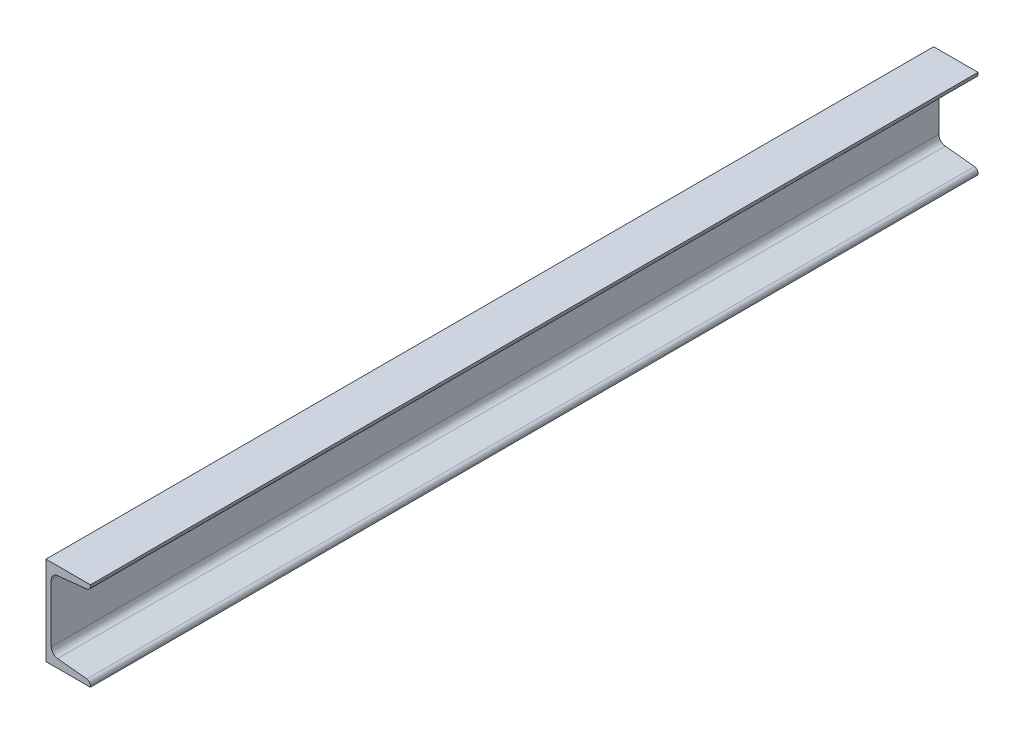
from build123d import *

# Parameters (mm, degrees)
EXTRUIR1_DEPTH = 1000


with BuildPart() as part:
    # Croquis1 → Extruir1 (new body)
    with BuildSketch(Plane.XY):
        with BuildLine():
            Line((0, 0), (0, 100))
            Line((0, 100), (50, 100))
            Line((50, 100), (50, 98.369366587))
            ThreePointArc((50, 98.369366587), (48.844151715, 95.358278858), (45.970378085, 93.894018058))
            Line((45.970378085, 93.894018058), (13.063772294, 90.435394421))
            ThreePointArc((13.063772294, 90.435394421), (7.954841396, 87.832264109), (5.9, 82.479219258))
            Line((5.9, 82.479219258), (5.9, 17.520780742))
            ThreePointArc((5.9, 17.520780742), (7.954841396, 12.167735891), (13.063772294, 9.564605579))
            Line((13.063772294, 9.564605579), (45.970378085, 6.105981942))
            ThreePointArc((45.970378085, 6.105981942), (48.844151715, 4.641721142), (50, 1.630633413))
            Line((50, 1.630633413), (50, 0))
            Line((50, 0), (0, 0))
        make_face()
    extrude(amount=EXTRUIR1_DEPTH)


solid = part.part
